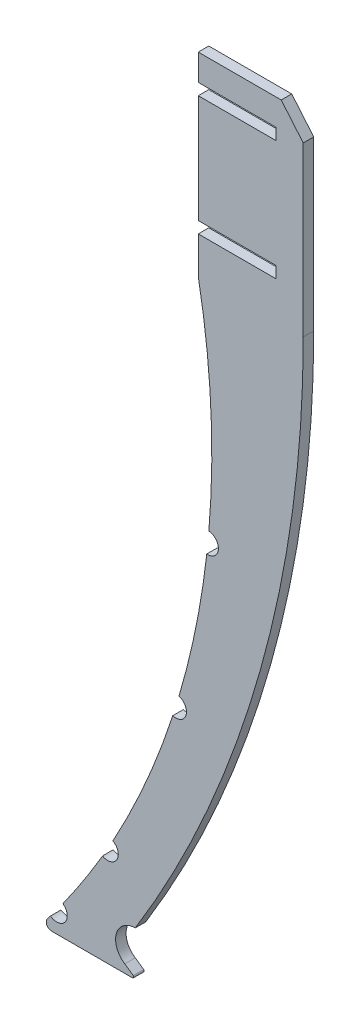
ISO-10303-21;
HEADER;
FILE_DESCRIPTION(('STEP AP214'),'2;1');
FILE_NAME('part.step','',(''),(''),'','','');
FILE_SCHEMA(('AUTOMOTIVE_DESIGN { 1 0 10303 214 1 1 1 1 }'));
ENDSEC;
DATA;
#1=APPLICATION_CONTEXT('core data for automotive mechanical design processes');
#2=APPLICATION_PROTOCOL_DEFINITION('international standard','automotive_design',2000,#1);
#3=PRODUCT_CONTEXT('',#1,'mechanical');
#4=PRODUCT('Part','Part','',(#3));
#5=PRODUCT_RELATED_PRODUCT_CATEGORY('part','',(#4));
#6=PRODUCT_DEFINITION_FORMATION('','',#4);
#7=PRODUCT_DEFINITION_CONTEXT('part definition',#1,'design');
#8=PRODUCT_DEFINITION('design','',#6,#7);
#9=PRODUCT_DEFINITION_SHAPE('','',#8);
#10=(LENGTH_UNIT() NAMED_UNIT(*) SI_UNIT(.MILLI.,.METRE.));
#11=(NAMED_UNIT(*) PLANE_ANGLE_UNIT() SI_UNIT($,.RADIAN.));
#12=(NAMED_UNIT(*) SI_UNIT($,.STERADIAN.) SOLID_ANGLE_UNIT());
#13=UNCERTAINTY_MEASURE_WITH_UNIT(LENGTH_MEASURE(1.E-05),#10,'distance_accuracy_value','');
#14=(GEOMETRIC_REPRESENTATION_CONTEXT(3) GLOBAL_UNCERTAINTY_ASSIGNED_CONTEXT((#13)) GLOBAL_UNIT_ASSIGNED_CONTEXT((#10,
#11,#12)) REPRESENTATION_CONTEXT('',''));
#15=CARTESIAN_POINT('',(0.,0.,0.));
#16=DIRECTION('',(0.,0.,1.));
#17=DIRECTION('',(1.,0.,0.));
#18=AXIS2_PLACEMENT_3D('',#15,#16,#17);
#19=CARTESIAN_POINT('',(-13.9999999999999,-155.222144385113,1.5));
#20=DIRECTION('',(-0.574159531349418,-0.81874344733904,0.));
#21=DIRECTION('',(-0.81874344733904,0.574159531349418,0.));
#22=AXIS2_PLACEMENT_3D('',#19,#20,#21);
#23=PLANE('',#22);
#24=DIRECTION('',(0.,0.,1.));
#25=VECTOR('',#24,1.);
#26=CARTESIAN_POINT('',(-12.3983756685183,-156.345314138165,1.5));
#27=LINE('',#26,#25);
#28=CARTESIAN_POINT('',(-12.3983756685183,-156.345314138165,-0.5));
#29=VERTEX_POINT('',#28);
#30=CARTESIAN_POINT('',(-12.3983756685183,-156.345314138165,1.5));
#31=VERTEX_POINT('',#30);
#32=EDGE_CURVE('E11',#29,#31,#27,.T.);
#33=ORIENTED_EDGE('',*,*,#32,.F.);
#34=DIRECTION('',(-0.81874344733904,0.574159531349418,0.));
#35=VECTOR('',#34,1.);
#36=CARTESIAN_POINT('',(-13.9999999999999,-155.222144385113,-0.5));
#37=LINE('',#36,#35);
#38=CARTESIAN_POINT('',(-14.,-155.222144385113,-0.5));
#39=VERTEX_POINT('',#38);
#40=EDGE_CURVE('E158',#29,#39,#37,.T.);
#41=ORIENTED_EDGE('',*,*,#40,.T.);
#42=DIRECTION('',(0.,0.,1.));
#43=VECTOR('',#42,1.);
#44=CARTESIAN_POINT('',(-13.9999999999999,-155.222144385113,1.5));
#45=LINE('',#44,#43);
#46=CARTESIAN_POINT('',(-13.9999999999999,-155.222144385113,1.5));
#47=VERTEX_POINT('',#46);
#48=EDGE_CURVE('E44',#39,#47,#45,.T.);
#49=ORIENTED_EDGE('',*,*,#48,.T.);
#50=DIRECTION('',(-0.81874344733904,0.574159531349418,0.));
#51=VECTOR('',#50,1.);
#52=CARTESIAN_POINT('',(-13.9999999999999,-155.222144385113,1.5));
#53=LINE('',#52,#51);
#54=EDGE_CURVE('E311',#31,#47,#53,.T.);
#55=ORIENTED_EDGE('',*,*,#54,.F.);
#56=EDGE_LOOP('',(#33,#41,#49,#55));
#57=FACE_BOUND('',#56,.T.);
#58=ADVANCED_FACE('F34',(#57),#23,.F.);
#59=CARTESIAN_POINT('',(-11.9999999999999,-152.05,1.5));
#60=DIRECTION('',(0.,0.,-1.));
#61=DIRECTION('',(-1.,0.,0.));
#62=AXIS2_PLACEMENT_3D('',#59,#60,#61);
#63=CYLINDRICAL_SURFACE('',#62,3.75000000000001);
#64=ORIENTED_EDGE('',*,*,#48,.F.);
#65=CARTESIAN_POINT('',(-11.9999999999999,-152.05,-0.5));
#66=DIRECTION('',(0.,0.,-1.));
#67=DIRECTION('',(-1.,0.,0.));
#68=AXIS2_PLACEMENT_3D('',#65,#66,#67);
#69=CIRCLE('',#68,3.75000000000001);
#70=CARTESIAN_POINT('',(-12.,-148.3,-0.5));
#71=VERTEX_POINT('',#70);
#72=EDGE_CURVE('E234',#39,#71,#69,.T.);
#73=ORIENTED_EDGE('',*,*,#72,.T.);
#74=DIRECTION('',(0.,0.,1.));
#75=VECTOR('',#74,1.);
#76=CARTESIAN_POINT('',(-12.,-148.3,1.5));
#77=LINE('',#76,#75);
#78=CARTESIAN_POINT('',(-12.,-148.3,1.5));
#79=VERTEX_POINT('',#78);
#80=EDGE_CURVE('E304',#71,#79,#77,.T.);
#81=ORIENTED_EDGE('',*,*,#80,.T.);
#82=CARTESIAN_POINT('',(-11.9999999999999,-152.05,1.5));
#83=DIRECTION('',(0.,0.,-1.));
#84=DIRECTION('',(1.,0.,0.));
#85=AXIS2_PLACEMENT_3D('',#82,#83,#84);
#86=CIRCLE('',#85,3.75000000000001);
#87=EDGE_CURVE('E320',#47,#79,#86,.T.);
#88=ORIENTED_EDGE('',*,*,#87,.F.);
#89=EDGE_LOOP('',(#64,#73,#81,#88));
#90=FACE_BOUND('',#89,.T.);
#91=ADVANCED_FACE('F323',(#90),#63,.F.);
#92=CARTESIAN_POINT('',(-197.285156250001,-34.8,1.5));
#93=DIRECTION('',(0.,0.,1.));
#94=DIRECTION('',(1.,0.,0.));
#95=AXIS2_PLACEMENT_3D('',#92,#93,#94);
#96=CYLINDRICAL_SURFACE('',#95,217.285156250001);
#97=ORIENTED_EDGE('',*,*,#80,.F.);
#98=CARTESIAN_POINT('',(-197.285156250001,-34.8,-0.5));
#99=DIRECTION('',(0.,0.,1.));
#100=DIRECTION('',(1.,0.,0.));
#101=AXIS2_PLACEMENT_3D('',#98,#99,#100);
#102=CIRCLE('',#101,217.285156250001);
#103=CARTESIAN_POINT('',(20.,-34.8,-0.5));
#104=VERTEX_POINT('',#103);
#105=EDGE_CURVE('E231',#71,#104,#102,.T.);
#106=ORIENTED_EDGE('',*,*,#105,.T.);
#107=DIRECTION('',(0.,0.,1.));
#108=VECTOR('',#107,1.);
#109=CARTESIAN_POINT('',(20.,-34.8,1.5));
#110=LINE('',#109,#108);
#111=CARTESIAN_POINT('',(20.,-34.8,1.5));
#112=VERTEX_POINT('',#111);
#113=EDGE_CURVE('E301',#104,#112,#110,.T.);
#114=ORIENTED_EDGE('',*,*,#113,.T.);
#115=CARTESIAN_POINT('',(-197.285156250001,-34.8,1.5));
#116=DIRECTION('',(0.,0.,1.));
#117=DIRECTION('',(-1.,0.,0.));
#118=AXIS2_PLACEMENT_3D('',#115,#116,#117);
#119=CIRCLE('',#118,217.285156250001);
#120=EDGE_CURVE('E324',#79,#112,#119,.T.);
#121=ORIENTED_EDGE('',*,*,#120,.F.);
#122=EDGE_LOOP('',(#97,#106,#114,#121));
#123=FACE_BOUND('',#122,.T.);
#124=ADVANCED_FACE('F516',(#123),#96,.T.);
#125=CARTESIAN_POINT('',(20.,2.2,1.5));
#126=DIRECTION('',(-1.,0.,0.));
#127=DIRECTION('',(0.,1.,0.));
#128=AXIS2_PLACEMENT_3D('',#125,#126,#127);
#129=PLANE('',#128);
#130=ORIENTED_EDGE('',*,*,#113,.F.);
#131=DIRECTION('',(0.,1.,0.));
#132=VECTOR('',#131,1.);
#133=CARTESIAN_POINT('',(20.,-34.8,-0.5));
#134=LINE('',#133,#132);
#135=CARTESIAN_POINT('',(20.,-2.80000000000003,-0.5));
#136=VERTEX_POINT('',#135);
#137=EDGE_CURVE('E228',#104,#136,#134,.T.);
#138=ORIENTED_EDGE('',*,*,#137,.T.);
#139=DIRECTION('',(0.,0.,1.));
#140=VECTOR('',#139,1.);
#141=CARTESIAN_POINT('',(20.,-2.80000000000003,1.5));
#142=LINE('',#141,#140);
#143=CARTESIAN_POINT('',(20.,-2.80000000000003,1.5));
#144=VERTEX_POINT('',#143);
#145=EDGE_CURVE('E298',#136,#144,#142,.T.);
#146=ORIENTED_EDGE('',*,*,#145,.T.);
#147=DIRECTION('',(0.,1.,0.));
#148=VECTOR('',#147,1.);
#149=CARTESIAN_POINT('',(20.,2.2,1.5));
#150=LINE('',#149,#148);
#151=EDGE_CURVE('E326',#112,#144,#150,.T.);
#152=ORIENTED_EDGE('',*,*,#151,.F.);
#153=EDGE_LOOP('',(#130,#138,#146,#152));
#154=FACE_BOUND('',#153,.T.);
#155=ADVANCED_FACE('F514',(#154),#129,.F.);
#156=CARTESIAN_POINT('',(15.8045018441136,2.2,1.5));
#157=DIRECTION('',(0.76604444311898,0.642787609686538,0.));
#158=DIRECTION('',(0.642787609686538,-0.76604444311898,0.));
#159=AXIS2_PLACEMENT_3D('',#156,#157,#158);
#160=PLANE('',#159);
#161=ORIENTED_EDGE('',*,*,#145,.F.);
#162=DIRECTION('',(0.642787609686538,-0.76604444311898,0.));
#163=VECTOR('',#162,1.);
#164=CARTESIAN_POINT('',(15.8045018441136,2.2,-0.5));
#165=LINE('',#164,#163);
#166=CARTESIAN_POINT('',(15.8045018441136,2.2,-0.5));
#167=VERTEX_POINT('',#166);
#168=EDGE_CURVE('E225',#136,#167,#165,.F.);
#169=ORIENTED_EDGE('',*,*,#168,.T.);
#170=DIRECTION('',(0.,0.,1.));
#171=VECTOR('',#170,1.);
#172=CARTESIAN_POINT('',(15.8045018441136,2.2,1.5));
#173=LINE('',#172,#171);
#174=CARTESIAN_POINT('',(15.8045018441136,2.2,1.5));
#175=VERTEX_POINT('',#174);
#176=EDGE_CURVE('E295',#167,#175,#173,.T.);
#177=ORIENTED_EDGE('',*,*,#176,.T.);
#178=DIRECTION('',(0.642787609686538,-0.76604444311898,0.));
#179=VECTOR('',#178,1.);
#180=CARTESIAN_POINT('',(15.8045018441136,2.2,1.5));
#181=LINE('',#180,#179);
#182=EDGE_CURVE('E332',#144,#175,#181,.F.);
#183=ORIENTED_EDGE('',*,*,#182,.F.);
#184=EDGE_LOOP('',(#161,#169,#177,#183));
#185=FACE_BOUND('',#184,.T.);
#186=ADVANCED_FACE('F509',(#185),#160,.T.);
#187=CARTESIAN_POINT('',(0.,2.2,1.5));
#188=DIRECTION('',(0.,-1.,0.));
#189=DIRECTION('',(-1.,0.,0.));
#190=AXIS2_PLACEMENT_3D('',#187,#188,#189);
#191=PLANE('',#190);
#192=ORIENTED_EDGE('',*,*,#176,.F.);
#193=DIRECTION('',(-1.,0.,0.));
#194=VECTOR('',#193,1.);
#195=CARTESIAN_POINT('',(-197.285156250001,2.2,-0.5));
#196=LINE('',#195,#194);
#197=CARTESIAN_POINT('',(0.,2.2,-0.5));
#198=VERTEX_POINT('',#197);
#199=EDGE_CURVE('E222',#167,#198,#196,.T.);
#200=ORIENTED_EDGE('',*,*,#199,.T.);
#201=DIRECTION('',(0.,0.,1.));
#202=VECTOR('',#201,1.);
#203=CARTESIAN_POINT('',(0.,2.2,1.5));
#204=LINE('',#203,#202);
#205=CARTESIAN_POINT('',(0.,2.2,1.5));
#206=VERTEX_POINT('',#205);
#207=EDGE_CURVE('E292',#198,#206,#204,.T.);
#208=ORIENTED_EDGE('',*,*,#207,.T.);
#209=DIRECTION('',(-1.,0.,0.));
#210=VECTOR('',#209,1.);
#211=CARTESIAN_POINT('',(0.,2.2,1.5));
#212=LINE('',#211,#210);
#213=EDGE_CURVE('E335',#175,#206,#212,.T.);
#214=ORIENTED_EDGE('',*,*,#213,.F.);
#215=EDGE_LOOP('',(#192,#200,#208,#214));
#216=FACE_BOUND('',#215,.T.);
#217=ADVANCED_FACE('F505',(#216),#191,.F.);
#218=CARTESIAN_POINT('',(0.,-2.8,1.5));
#219=DIRECTION('',(1.,0.,0.));
#220=DIRECTION('',(0.,-1.,0.));
#221=AXIS2_PLACEMENT_3D('',#218,#219,#220);
#222=PLANE('',#221);
#223=ORIENTED_EDGE('',*,*,#207,.F.);
#224=DIRECTION('',(0.,1.,0.));
#225=VECTOR('',#224,1.);
#226=CARTESIAN_POINT('',(0.,-34.8,-0.5));
#227=LINE('',#226,#225);
#228=CARTESIAN_POINT('',(0.,-2.8,-0.5));
#229=VERTEX_POINT('',#228);
#230=EDGE_CURVE('E219',#198,#229,#227,.F.);
#231=ORIENTED_EDGE('',*,*,#230,.T.);
#232=DIRECTION('',(0.,0.,1.));
#233=VECTOR('',#232,1.);
#234=CARTESIAN_POINT('',(0.,-2.8,1.5));
#235=LINE('',#234,#233);
#236=CARTESIAN_POINT('',(0.,-2.8,1.5));
#237=VERTEX_POINT('',#236);
#238=EDGE_CURVE('E289',#229,#237,#235,.T.);
#239=ORIENTED_EDGE('',*,*,#238,.T.);
#240=DIRECTION('',(0.,-1.,0.));
#241=VECTOR('',#240,1.);
#242=CARTESIAN_POINT('',(0.,-2.8,1.5));
#243=LINE('',#242,#241);
#244=EDGE_CURVE('E338',#206,#237,#243,.T.);
#245=ORIENTED_EDGE('',*,*,#244,.F.);
#246=EDGE_LOOP('',(#223,#231,#239,#245));
#247=FACE_BOUND('',#246,.T.);
#248=ADVANCED_FACE('F502',(#247),#222,.F.);
#249=CARTESIAN_POINT('',(0.,-2.8,1.5));
#250=DIRECTION('',(0.,1.,0.));
#251=DIRECTION('',(1.,0.,0.));
#252=AXIS2_PLACEMENT_3D('',#249,#250,#251);
#253=PLANE('',#252);
#254=ORIENTED_EDGE('',*,*,#238,.F.);
#255=DIRECTION('',(-1.,0.,0.));
#256=VECTOR('',#255,1.);
#257=CARTESIAN_POINT('',(-197.285156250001,-2.8,-0.5));
#258=LINE('',#257,#256);
#259=CARTESIAN_POINT('',(14.77,-2.8,-0.5));
#260=VERTEX_POINT('',#259);
#261=EDGE_CURVE('E216',#229,#260,#258,.F.);
#262=ORIENTED_EDGE('',*,*,#261,.T.);
#263=DIRECTION('',(0.,0.,1.));
#264=VECTOR('',#263,1.);
#265=CARTESIAN_POINT('',(14.77,-2.8,1.5));
#266=LINE('',#265,#264);
#267=CARTESIAN_POINT('',(14.77,-2.8,1.5));
#268=VERTEX_POINT('',#267);
#269=EDGE_CURVE('E286',#260,#268,#266,.T.);
#270=ORIENTED_EDGE('',*,*,#269,.T.);
#271=DIRECTION('',(1.,0.,0.));
#272=VECTOR('',#271,1.);
#273=CARTESIAN_POINT('',(0.,-2.8,1.5));
#274=LINE('',#273,#272);
#275=EDGE_CURVE('E341',#237,#268,#274,.T.);
#276=ORIENTED_EDGE('',*,*,#275,.F.);
#277=EDGE_LOOP('',(#254,#262,#270,#276));
#278=FACE_BOUND('',#277,.T.);
#279=ADVANCED_FACE('F497',(#278),#253,.F.);
#280=CARTESIAN_POINT('',(14.77,-2.8,1.5));
#281=DIRECTION('',(1.,0.,0.));
#282=DIRECTION('',(0.,-1.,0.));
#283=AXIS2_PLACEMENT_3D('',#280,#281,#282);
#284=PLANE('',#283);
#285=ORIENTED_EDGE('',*,*,#269,.F.);
#286=DIRECTION('',(0.,1.,0.));
#287=VECTOR('',#286,1.);
#288=CARTESIAN_POINT('',(14.77,-34.8,-0.5));
#289=LINE('',#288,#287);
#290=CARTESIAN_POINT('',(14.77,-5.,-0.5));
#291=VERTEX_POINT('',#290);
#292=EDGE_CURVE('E213',#260,#291,#289,.F.);
#293=ORIENTED_EDGE('',*,*,#292,.T.);
#294=DIRECTION('',(0.,0.,1.));
#295=VECTOR('',#294,1.);
#296=CARTESIAN_POINT('',(14.77,-5.,1.5));
#297=LINE('',#296,#295);
#298=CARTESIAN_POINT('',(14.77,-5.,1.5));
#299=VERTEX_POINT('',#298);
#300=EDGE_CURVE('E283',#291,#299,#297,.T.);
#301=ORIENTED_EDGE('',*,*,#300,.T.);
#302=DIRECTION('',(0.,-1.,0.));
#303=VECTOR('',#302,1.);
#304=CARTESIAN_POINT('',(14.77,-2.8,1.5));
#305=LINE('',#304,#303);
#306=EDGE_CURVE('E344',#268,#299,#305,.T.);
#307=ORIENTED_EDGE('',*,*,#306,.F.);
#308=EDGE_LOOP('',(#285,#293,#301,#307));
#309=FACE_BOUND('',#308,.T.);
#310=ADVANCED_FACE('F493',(#309),#284,.F.);
#311=CARTESIAN_POINT('',(0.,-5.,1.5));
#312=DIRECTION('',(0.,-1.,0.));
#313=DIRECTION('',(-1.,0.,0.));
#314=AXIS2_PLACEMENT_3D('',#311,#312,#313);
#315=PLANE('',#314);
#316=ORIENTED_EDGE('',*,*,#300,.F.);
#317=DIRECTION('',(-1.,0.,0.));
#318=VECTOR('',#317,1.);
#319=CARTESIAN_POINT('',(-197.285156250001,-5.,-0.5));
#320=LINE('',#319,#318);
#321=CARTESIAN_POINT('',(0.,-5.,-0.5));
#322=VERTEX_POINT('',#321);
#323=EDGE_CURVE('E210',#291,#322,#320,.T.);
#324=ORIENTED_EDGE('',*,*,#323,.T.);
#325=DIRECTION('',(0.,0.,1.));
#326=VECTOR('',#325,1.);
#327=CARTESIAN_POINT('',(0.,-5.,1.5));
#328=LINE('',#327,#326);
#329=CARTESIAN_POINT('',(0.,-5.,1.5));
#330=VERTEX_POINT('',#329);
#331=EDGE_CURVE('E280',#322,#330,#328,.T.);
#332=ORIENTED_EDGE('',*,*,#331,.T.);
#333=DIRECTION('',(-1.,0.,0.));
#334=VECTOR('',#333,1.);
#335=CARTESIAN_POINT('',(0.,-5.,1.5));
#336=LINE('',#335,#334);
#337=EDGE_CURVE('E347',#299,#330,#336,.T.);
#338=ORIENTED_EDGE('',*,*,#337,.F.);
#339=EDGE_LOOP('',(#316,#324,#332,#338));
#340=FACE_BOUND('',#339,.T.);
#341=ADVANCED_FACE('F490',(#340),#315,.F.);
#342=CARTESIAN_POINT('',(0.,-5.,1.5));
#343=DIRECTION('',(1.,0.,0.));
#344=DIRECTION('',(0.,-1.,0.));
#345=AXIS2_PLACEMENT_3D('',#342,#343,#344);
#346=PLANE('',#345);
#347=ORIENTED_EDGE('',*,*,#331,.F.);
#348=DIRECTION('',(0.,1.,0.));
#349=VECTOR('',#348,1.);
#350=CARTESIAN_POINT('',(0.,-34.8,-0.5));
#351=LINE('',#350,#349);
#352=CARTESIAN_POINT('',(0.,-25.6,-0.5));
#353=VERTEX_POINT('',#352);
#354=EDGE_CURVE('E207',#322,#353,#351,.F.);
#355=ORIENTED_EDGE('',*,*,#354,.T.);
#356=DIRECTION('',(0.,0.,1.));
#357=VECTOR('',#356,1.);
#358=CARTESIAN_POINT('',(0.,-25.6,1.5));
#359=LINE('',#358,#357);
#360=CARTESIAN_POINT('',(0.,-25.6,1.5));
#361=VERTEX_POINT('',#360);
#362=EDGE_CURVE('E277',#353,#361,#359,.T.);
#363=ORIENTED_EDGE('',*,*,#362,.T.);
#364=DIRECTION('',(0.,-1.,0.));
#365=VECTOR('',#364,1.);
#366=CARTESIAN_POINT('',(0.,-5.,1.5));
#367=LINE('',#366,#365);
#368=EDGE_CURVE('E350',#330,#361,#367,.T.);
#369=ORIENTED_EDGE('',*,*,#368,.F.);
#370=EDGE_LOOP('',(#347,#355,#363,#369));
#371=FACE_BOUND('',#370,.T.);
#372=ADVANCED_FACE('F485',(#371),#346,.F.);
#373=CARTESIAN_POINT('',(0.,-25.6,1.5));
#374=DIRECTION('',(0.,1.,0.));
#375=DIRECTION('',(1.,0.,0.));
#376=AXIS2_PLACEMENT_3D('',#373,#374,#375);
#377=PLANE('',#376);
#378=ORIENTED_EDGE('',*,*,#362,.F.);
#379=DIRECTION('',(-1.,0.,0.));
#380=VECTOR('',#379,1.);
#381=CARTESIAN_POINT('',(-197.285156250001,-25.6,-0.5));
#382=LINE('',#381,#380);
#383=CARTESIAN_POINT('',(14.77,-25.6,-0.5));
#384=VERTEX_POINT('',#383);
#385=EDGE_CURVE('E204',#353,#384,#382,.F.);
#386=ORIENTED_EDGE('',*,*,#385,.T.);
#387=DIRECTION('',(0.,0.,1.));
#388=VECTOR('',#387,1.);
#389=CARTESIAN_POINT('',(14.77,-25.6,1.5));
#390=LINE('',#389,#388);
#391=CARTESIAN_POINT('',(14.77,-25.6,1.5));
#392=VERTEX_POINT('',#391);
#393=EDGE_CURVE('E274',#384,#392,#390,.T.);
#394=ORIENTED_EDGE('',*,*,#393,.T.);
#395=DIRECTION('',(1.,0.,0.));
#396=VECTOR('',#395,1.);
#397=CARTESIAN_POINT('',(0.,-25.6,1.5));
#398=LINE('',#397,#396);
#399=EDGE_CURVE('E353',#361,#392,#398,.T.);
#400=ORIENTED_EDGE('',*,*,#399,.F.);
#401=EDGE_LOOP('',(#378,#386,#394,#400));
#402=FACE_BOUND('',#401,.T.);
#403=ADVANCED_FACE('F481',(#402),#377,.F.);
#404=CARTESIAN_POINT('',(14.77,-25.6,1.5));
#405=DIRECTION('',(1.,0.,0.));
#406=DIRECTION('',(0.,-1.,0.));
#407=AXIS2_PLACEMENT_3D('',#404,#405,#406);
#408=PLANE('',#407);
#409=ORIENTED_EDGE('',*,*,#393,.F.);
#410=DIRECTION('',(0.,1.,0.));
#411=VECTOR('',#410,1.);
#412=CARTESIAN_POINT('',(14.77,-34.8,-0.5));
#413=LINE('',#412,#411);
#414=CARTESIAN_POINT('',(14.77,-27.8,-0.5));
#415=VERTEX_POINT('',#414);
#416=EDGE_CURVE('E201',#384,#415,#413,.F.);
#417=ORIENTED_EDGE('',*,*,#416,.T.);
#418=DIRECTION('',(0.,0.,1.));
#419=VECTOR('',#418,1.);
#420=CARTESIAN_POINT('',(14.77,-27.8,1.5));
#421=LINE('',#420,#419);
#422=CARTESIAN_POINT('',(14.77,-27.8,1.5));
#423=VERTEX_POINT('',#422);
#424=EDGE_CURVE('E271',#415,#423,#421,.T.);
#425=ORIENTED_EDGE('',*,*,#424,.T.);
#426=DIRECTION('',(0.,-1.,0.));
#427=VECTOR('',#426,1.);
#428=CARTESIAN_POINT('',(14.77,-25.6,1.5));
#429=LINE('',#428,#427);
#430=EDGE_CURVE('E356',#392,#423,#429,.T.);
#431=ORIENTED_EDGE('',*,*,#430,.F.);
#432=EDGE_LOOP('',(#409,#417,#425,#431));
#433=FACE_BOUND('',#432,.T.);
#434=ADVANCED_FACE('F478',(#433),#408,.F.);
#435=CARTESIAN_POINT('',(0.,-27.8,1.5));
#436=DIRECTION('',(0.,-1.,0.));
#437=DIRECTION('',(-1.,0.,0.));
#438=AXIS2_PLACEMENT_3D('',#435,#436,#437);
#439=PLANE('',#438);
#440=ORIENTED_EDGE('',*,*,#424,.F.);
#441=DIRECTION('',(-1.,0.,0.));
#442=VECTOR('',#441,1.);
#443=CARTESIAN_POINT('',(-197.285156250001,-27.8,-0.5));
#444=LINE('',#443,#442);
#445=CARTESIAN_POINT('',(0.,-27.8,-0.5));
#446=VERTEX_POINT('',#445);
#447=EDGE_CURVE('E198',#415,#446,#444,.T.);
#448=ORIENTED_EDGE('',*,*,#447,.T.);
#449=DIRECTION('',(0.,0.,1.));
#450=VECTOR('',#449,1.);
#451=CARTESIAN_POINT('',(0.,-27.8,1.5));
#452=LINE('',#451,#450);
#453=CARTESIAN_POINT('',(0.,-27.8,1.5));
#454=VERTEX_POINT('',#453);
#455=EDGE_CURVE('E268',#446,#454,#452,.T.);
#456=ORIENTED_EDGE('',*,*,#455,.T.);
#457=DIRECTION('',(-1.,0.,0.));
#458=VECTOR('',#457,1.);
#459=CARTESIAN_POINT('',(0.,-27.8,1.5));
#460=LINE('',#459,#458);
#461=EDGE_CURVE('E359',#423,#454,#460,.T.);
#462=ORIENTED_EDGE('',*,*,#461,.F.);
#463=EDGE_LOOP('',(#440,#448,#456,#462));
#464=FACE_BOUND('',#463,.T.);
#465=ADVANCED_FACE('F473',(#464),#439,.F.);
#466=CARTESIAN_POINT('',(0.,-27.8,1.5));
#467=DIRECTION('',(1.,0.,0.));
#468=DIRECTION('',(0.,-1.,0.));
#469=AXIS2_PLACEMENT_3D('',#466,#467,#468);
#470=PLANE('',#469);
#471=ORIENTED_EDGE('',*,*,#455,.F.);
#472=DIRECTION('',(0.,1.,0.));
#473=VECTOR('',#472,1.);
#474=CARTESIAN_POINT('',(0.,-34.8,-0.5));
#475=LINE('',#474,#473);
#476=CARTESIAN_POINT('',(0.,-34.8,-0.5));
#477=VERTEX_POINT('',#476);
#478=EDGE_CURVE('E195',#446,#477,#475,.F.);
#479=ORIENTED_EDGE('',*,*,#478,.T.);
#480=DIRECTION('',(0.,0.,1.));
#481=VECTOR('',#480,1.);
#482=CARTESIAN_POINT('',(0.,-34.8,1.5));
#483=LINE('',#482,#481);
#484=CARTESIAN_POINT('',(0.,-34.8,1.5));
#485=VERTEX_POINT('',#484);
#486=EDGE_CURVE('E265',#477,#485,#483,.T.);
#487=ORIENTED_EDGE('',*,*,#486,.T.);
#488=DIRECTION('',(0.,-1.,0.));
#489=VECTOR('',#488,1.);
#490=CARTESIAN_POINT('',(0.,-27.8,1.5));
#491=LINE('',#490,#489);
#492=EDGE_CURVE('E362',#454,#485,#491,.T.);
#493=ORIENTED_EDGE('',*,*,#492,.F.);
#494=EDGE_LOOP('',(#471,#479,#487,#493));
#495=FACE_BOUND('',#494,.T.);
#496=ADVANCED_FACE('F469',(#495),#470,.F.);
#497=CARTESIAN_POINT('',(-149.53282032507,-62.7181589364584,1.5));
#498=DIRECTION('',(0.,0.,-1.));
#499=DIRECTION('',(-1.,0.,0.));
#500=AXIS2_PLACEMENT_3D('',#497,#498,#499);
#501=CYLINDRICAL_SURFACE('',#500,152.11669189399);
#502=ORIENTED_EDGE('',*,*,#486,.F.);
#503=CARTESIAN_POINT('',(-149.53282032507,-62.7181589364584,-0.5));
#504=DIRECTION('',(0.,0.,-1.));
#505=DIRECTION('',(-1.,0.,0.));
#506=AXIS2_PLACEMENT_3D('',#503,#504,#505);
#507=CIRCLE('',#506,152.11669189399);
#508=CARTESIAN_POINT('',(2.01957480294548,-75.8085937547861,-0.5));
#509=VERTEX_POINT('',#508);
#510=EDGE_CURVE('E192',#477,#509,#507,.T.);
#511=ORIENTED_EDGE('',*,*,#510,.T.);
#512=DIRECTION('',(0.,0.,1.));
#513=VECTOR('',#512,1.);
#514=CARTESIAN_POINT('',(2.01957480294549,-75.8085937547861,1.5));
#515=LINE('',#514,#513);
#516=CARTESIAN_POINT('',(2.01957480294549,-75.8085937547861,1.5));
#517=VERTEX_POINT('',#516);
#518=EDGE_CURVE('E262',#509,#517,#515,.T.);
#519=ORIENTED_EDGE('',*,*,#518,.T.);
#520=CARTESIAN_POINT('',(-149.53282032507,-62.7181589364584,1.5));
#521=DIRECTION('',(0.,0.,-1.));
#522=DIRECTION('',(-1.,0.,0.));
#523=AXIS2_PLACEMENT_3D('',#520,#521,#522);
#524=CIRCLE('',#523,152.11669189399);
#525=EDGE_CURVE('E365',#485,#517,#524,.T.);
#526=ORIENTED_EDGE('',*,*,#525,.F.);
#527=EDGE_LOOP('',(#502,#511,#519,#526));
#528=FACE_BOUND('',#527,.T.);
#529=ADVANCED_FACE('F465',(#528),#501,.F.);
#530=CARTESIAN_POINT('',(1.83436906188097,-77.8,1.5));
#531=DIRECTION('',(0.,0.,1.));
#532=DIRECTION('',(1.,0.,0.));
#533=AXIS2_PLACEMENT_3D('',#530,#531,#532);
#534=CYLINDRICAL_SURFACE('',#533,2.);
#535=ORIENTED_EDGE('',*,*,#518,.F.);
#536=CARTESIAN_POINT('',(1.83436906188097,-77.8,-0.5));
#537=DIRECTION('',(0.,0.,1.));
#538=DIRECTION('',(1.,0.,0.));
#539=AXIS2_PLACEMENT_3D('',#536,#537,#538);
#540=CIRCLE('',#539,2.);
#541=CARTESIAN_POINT('',(1.62299728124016,-79.7887991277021,-0.5));
#542=VERTEX_POINT('',#541);
#543=EDGE_CURVE('E189',#542,#509,#540,.T.);
#544=ORIENTED_EDGE('',*,*,#543,.F.);
#545=DIRECTION('',(0.,0.,1.));
#546=VECTOR('',#545,1.);
#547=CARTESIAN_POINT('',(1.62299728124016,-79.7887991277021,1.5));
#548=LINE('',#547,#546);
#549=CARTESIAN_POINT('',(1.62299728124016,-79.7887991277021,1.5));
#550=VERTEX_POINT('',#549);
#551=EDGE_CURVE('E259',#542,#550,#548,.T.);
#552=ORIENTED_EDGE('',*,*,#551,.T.);
#553=CARTESIAN_POINT('',(1.83436906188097,-77.8,1.5));
#554=DIRECTION('',(0.,0.,1.));
#555=DIRECTION('',(1.,0.,0.));
#556=AXIS2_PLACEMENT_3D('',#553,#554,#555);
#557=CIRCLE('',#556,2.);
#558=EDGE_CURVE('E368',#550,#517,#557,.T.);
#559=ORIENTED_EDGE('',*,*,#558,.T.);
#560=EDGE_LOOP('',(#535,#544,#552,#559));
#561=FACE_BOUND('',#560,.T.);
#562=ADVANCED_FACE('F460',(#561),#534,.F.);
#563=ORIENTED_EDGE('',*,*,#551,.F.);
#564=CARTESIAN_POINT('',(-149.53282032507,-62.7181589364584,-0.5));
#565=DIRECTION('',(0.,0.,-1.));
#566=DIRECTION('',(-1.,0.,0.));
#567=AXIS2_PLACEMENT_3D('',#564,#565,#566);
#568=CIRCLE('',#567,152.11669189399);
#569=CARTESIAN_POINT('',(-3.66978203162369,-105.885994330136,-0.5));
#570=VERTEX_POINT('',#569);
#571=EDGE_CURVE('E186',#542,#570,#568,.T.);
#572=ORIENTED_EDGE('',*,*,#571,.T.);
#573=DIRECTION('',(0.,0.,1.));
#574=VECTOR('',#573,1.);
#575=CARTESIAN_POINT('',(-3.66978203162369,-105.885994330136,1.5));
#576=LINE('',#575,#574);
#577=CARTESIAN_POINT('',(-3.66978203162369,-105.885994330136,1.5));
#578=VERTEX_POINT('',#577);
#579=EDGE_CURVE('E256',#570,#578,#576,.T.);
#580=ORIENTED_EDGE('',*,*,#579,.T.);
#581=EDGE_CURVE('E370',#550,#578,#524,.T.);
#582=ORIENTED_EDGE('',*,*,#581,.F.);
#583=EDGE_LOOP('',(#563,#572,#580,#582));
#584=FACE_BOUND('',#583,.T.);
#585=ADVANCED_FACE('F461',(#584),#501,.F.);
#586=CARTESIAN_POINT('',(-4.24993916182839,-107.8,1.5));
#587=DIRECTION('',(0.,0.,1.));
#588=DIRECTION('',(1.,0.,0.));
#589=AXIS2_PLACEMENT_3D('',#586,#587,#588);
#590=CYLINDRICAL_SURFACE('',#589,2.);
#591=ORIENTED_EDGE('',*,*,#579,.F.);
#592=CARTESIAN_POINT('',(-4.24993916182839,-107.8,-0.5));
#593=DIRECTION('',(0.,0.,1.));
#594=DIRECTION('',(1.,0.,0.));
#595=AXIS2_PLACEMENT_3D('',#592,#593,#594);
#596=CIRCLE('',#595,2.);
#597=CARTESIAN_POINT('',(-4.85521056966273,-109.706212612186,-0.5));
#598=VERTEX_POINT('',#597);
#599=EDGE_CURVE('E183',#598,#570,#596,.T.);
#600=ORIENTED_EDGE('',*,*,#599,.F.);
#601=DIRECTION('',(0.,0.,1.));
#602=VECTOR('',#601,1.);
#603=CARTESIAN_POINT('',(-4.85521056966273,-109.706212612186,1.5));
#604=LINE('',#603,#602);
#605=CARTESIAN_POINT('',(-4.85521056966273,-109.706212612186,1.5));
#606=VERTEX_POINT('',#605);
#607=EDGE_CURVE('E253',#598,#606,#604,.T.);
#608=ORIENTED_EDGE('',*,*,#607,.T.);
#609=CARTESIAN_POINT('',(-4.24993916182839,-107.8,1.5));
#610=DIRECTION('',(0.,0.,1.));
#611=DIRECTION('',(1.,0.,0.));
#612=AXIS2_PLACEMENT_3D('',#609,#610,#611);
#613=CIRCLE('',#612,2.);
#614=EDGE_CURVE('E373',#606,#578,#613,.T.);
#615=ORIENTED_EDGE('',*,*,#614,.T.);
#616=EDGE_LOOP('',(#591,#600,#608,#615));
#617=FACE_BOUND('',#616,.T.);
#618=ADVANCED_FACE('F402',(#617),#590,.F.);
#619=ORIENTED_EDGE('',*,*,#607,.F.);
#620=CARTESIAN_POINT('',(-149.53282032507,-62.7181589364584,-0.5));
#621=DIRECTION('',(0.,0.,-1.));
#622=DIRECTION('',(-1.,0.,0.));
#623=AXIS2_PLACEMENT_3D('',#620,#621,#622);
#624=CIRCLE('',#623,152.11669189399);
#625=CARTESIAN_POINT('',(-16.261215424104,-136.054147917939,-0.5));
#626=VERTEX_POINT('',#625);
#627=EDGE_CURVE('E180',#598,#626,#624,.T.);
#628=ORIENTED_EDGE('',*,*,#627,.T.);
#629=DIRECTION('',(0.,0.,1.));
#630=VECTOR('',#629,1.);
#631=CARTESIAN_POINT('',(-16.261215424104,-136.054147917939,1.5));
#632=LINE('',#631,#630);
#633=CARTESIAN_POINT('',(-16.261215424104,-136.054147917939,1.5));
#634=VERTEX_POINT('',#633);
#635=EDGE_CURVE('E250',#626,#634,#632,.T.);
#636=ORIENTED_EDGE('',*,*,#635,.T.);
#637=EDGE_CURVE('E376',#606,#634,#524,.T.);
#638=ORIENTED_EDGE('',*,*,#637,.F.);
#639=EDGE_LOOP('',(#619,#628,#636,#638));
#640=FACE_BOUND('',#639,.T.);
#641=ADVANCED_FACE('F407',(#640),#501,.F.);
#642=CARTESIAN_POINT('',(-17.2369205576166,-137.8,1.5));
#643=DIRECTION('',(0.,0.,1.));
#644=DIRECTION('',(1.,0.,0.));
#645=AXIS2_PLACEMENT_3D('',#642,#643,#644);
#646=CYLINDRICAL_SURFACE('',#645,2.);
#647=ORIENTED_EDGE('',*,*,#635,.F.);
#648=CARTESIAN_POINT('',(-17.2369205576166,-137.8,-0.5));
#649=DIRECTION('',(0.,0.,1.));
#650=DIRECTION('',(1.,0.,0.));
#651=AXIS2_PLACEMENT_3D('',#648,#649,#650);
#652=CIRCLE('',#651,2.);
#653=CARTESIAN_POINT('',(-18.2354949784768,-139.532873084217,-0.5));
#654=VERTEX_POINT('',#653);
#655=EDGE_CURVE('E177',#654,#626,#652,.T.);
#656=ORIENTED_EDGE('',*,*,#655,.F.);
#657=DIRECTION('',(0.,0.,1.));
#658=VECTOR('',#657,1.);
#659=CARTESIAN_POINT('',(-18.2354949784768,-139.532873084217,1.5));
#660=LINE('',#659,#658);
#661=CARTESIAN_POINT('',(-18.2354949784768,-139.532873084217,1.5));
#662=VERTEX_POINT('',#661);
#663=EDGE_CURVE('E247',#654,#662,#660,.T.);
#664=ORIENTED_EDGE('',*,*,#663,.T.);
#665=CARTESIAN_POINT('',(-17.2369205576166,-137.8,1.5));
#666=DIRECTION('',(0.,0.,1.));
#667=DIRECTION('',(1.,0.,0.));
#668=AXIS2_PLACEMENT_3D('',#665,#666,#667);
#669=CIRCLE('',#668,2.);
#670=EDGE_CURVE('E377',#662,#634,#669,.T.);
#671=ORIENTED_EDGE('',*,*,#670,.T.);
#672=EDGE_LOOP('',(#647,#656,#664,#671));
#673=FACE_BOUND('',#672,.T.);
#674=ADVANCED_FACE('F412',(#673),#646,.F.);
#675=ORIENTED_EDGE('',*,*,#663,.F.);
#676=CARTESIAN_POINT('',(-149.53282032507,-62.7181589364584,-0.5));
#677=DIRECTION('',(0.,0.,-1.));
#678=DIRECTION('',(-1.,0.,0.));
#679=AXIS2_PLACEMENT_3D('',#676,#677,#678);
#680=CIRCLE('',#679,152.11669189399);
#681=CARTESIAN_POINT('',(-25.7835758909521,-151.18065073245,-0.5));
#682=VERTEX_POINT('',#681);
#683=EDGE_CURVE('E174',#654,#682,#680,.T.);
#684=ORIENTED_EDGE('',*,*,#683,.T.);
#685=DIRECTION('',(0.,0.,1.));
#686=VECTOR('',#685,1.);
#687=CARTESIAN_POINT('',(-25.7835758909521,-151.18065073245,1.5));
#688=LINE('',#687,#686);
#689=CARTESIAN_POINT('',(-25.7835758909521,-151.18065073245,1.5));
#690=VERTEX_POINT('',#689);
#691=EDGE_CURVE('E244',#682,#690,#688,.T.);
#692=ORIENTED_EDGE('',*,*,#691,.T.);
#693=EDGE_CURVE('E379',#662,#690,#524,.T.);
#694=ORIENTED_EDGE('',*,*,#693,.F.);
#695=EDGE_LOOP('',(#675,#684,#692,#694));
#696=FACE_BOUND('',#695,.T.);
#697=ADVANCED_FACE('F689',(#696),#501,.F.);
#698=CARTESIAN_POINT('',(-26.9573339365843,-152.8,1.5));
#699=DIRECTION('',(0.,0.,1.));
#700=DIRECTION('',(1.,0.,0.));
#701=AXIS2_PLACEMENT_3D('',#698,#699,#700);
#702=CYLINDRICAL_SURFACE('',#701,2.);
#703=ORIENTED_EDGE('',*,*,#691,.F.);
#704=CARTESIAN_POINT('',(-26.9573339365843,-152.8,-0.5));
#705=DIRECTION('',(0.,0.,1.));
#706=DIRECTION('',(1.,0.,0.));
#707=AXIS2_PLACEMENT_3D('',#704,#705,#706);
#708=CIRCLE('',#707,2.);
#709=CARTESIAN_POINT('',(-28.1522809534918,-154.403777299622,-0.5));
#710=VERTEX_POINT('',#709);
#711=EDGE_CURVE('E171',#710,#682,#708,.T.);
#712=ORIENTED_EDGE('',*,*,#711,.F.);
#713=DIRECTION('',(0.,0.,1.));
#714=VECTOR('',#713,1.);
#715=CARTESIAN_POINT('',(-28.1522809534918,-154.403777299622,1.5));
#716=LINE('',#715,#714);
#717=CARTESIAN_POINT('',(-28.1522809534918,-154.403777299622,1.5));
#718=VERTEX_POINT('',#717);
#719=EDGE_CURVE('E241',#710,#718,#716,.T.);
#720=ORIENTED_EDGE('',*,*,#719,.T.);
#721=CARTESIAN_POINT('',(-26.9573339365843,-152.8,1.5));
#722=DIRECTION('',(0.,0.,1.));
#723=DIRECTION('',(1.,0.,0.));
#724=AXIS2_PLACEMENT_3D('',#721,#722,#723);
#725=CIRCLE('',#724,2.);
#726=EDGE_CURVE('E380',#718,#690,#725,.T.);
#727=ORIENTED_EDGE('',*,*,#726,.T.);
#728=EDGE_LOOP('',(#703,#712,#720,#727));
#729=FACE_BOUND('',#728,.T.);
#730=ADVANCED_FACE('F418',(#729),#702,.F.);
#731=ORIENTED_EDGE('',*,*,#719,.F.);
#732=CARTESIAN_POINT('',(-149.53282032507,-62.7181589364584,-0.5));
#733=DIRECTION('',(0.,0.,-1.));
#734=DIRECTION('',(-1.,0.,0.));
#735=AXIS2_PLACEMENT_3D('',#732,#733,#734);
#736=CIRCLE('',#735,152.11669189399);
#737=CARTESIAN_POINT('',(-28.7517752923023,-155.19208560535,-0.5));
#738=VERTEX_POINT('',#737);
#739=EDGE_CURVE('E168',#710,#738,#736,.T.);
#740=ORIENTED_EDGE('',*,*,#739,.T.);
#741=DIRECTION('',(0.,0.,1.));
#742=VECTOR('',#741,1.);
#743=CARTESIAN_POINT('',(-28.7517752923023,-155.19208560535,1.5));
#744=LINE('',#743,#742);
#745=CARTESIAN_POINT('',(-28.7517752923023,-155.19208560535,1.5));
#746=VERTEX_POINT('',#745);
#747=EDGE_CURVE('E239',#738,#746,#744,.T.);
#748=ORIENTED_EDGE('',*,*,#747,.T.);
#749=EDGE_CURVE('E369',#718,#746,#524,.T.);
#750=ORIENTED_EDGE('',*,*,#749,.F.);
#751=EDGE_LOOP('',(#731,#740,#748,#750));
#752=FACE_BOUND('',#751,.T.);
#753=ADVANCED_FACE('F423',(#752),#501,.F.);
#754=CARTESIAN_POINT('',(-27.9577727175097,-155.8,1.5));
#755=DIRECTION('',(0.,0.,-1.));
#756=DIRECTION('',(-1.,0.,0.));
#757=AXIS2_PLACEMENT_3D('',#754,#755,#756);
#758=CYLINDRICAL_SURFACE('',#757,1.);
#759=ORIENTED_EDGE('',*,*,#747,.F.);
#760=CARTESIAN_POINT('',(-27.9577727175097,-155.8,-0.5));
#761=DIRECTION('',(0.,0.,-1.));
#762=DIRECTION('',(-1.,0.,0.));
#763=AXIS2_PLACEMENT_3D('',#760,#761,#762);
#764=CIRCLE('',#763,1.);
#765=CARTESIAN_POINT('',(-27.9577727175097,-156.8,-0.5));
#766=VERTEX_POINT('',#765);
#767=EDGE_CURVE('E165',#738,#766,#764,.F.);
#768=ORIENTED_EDGE('',*,*,#767,.T.);
#769=DIRECTION('',(0.,0.,1.));
#770=VECTOR('',#769,1.);
#771=CARTESIAN_POINT('',(-27.9577727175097,-156.8,1.5));
#772=LINE('',#771,#770);
#773=CARTESIAN_POINT('',(-27.9577727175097,-156.8,1.5));
#774=VERTEX_POINT('',#773);
#775=EDGE_CURVE('E52',#766,#774,#772,.T.);
#776=ORIENTED_EDGE('',*,*,#775,.T.);
#777=CARTESIAN_POINT('',(-27.9577727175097,-155.8,1.5));
#778=DIRECTION('',(0.,0.,-1.));
#779=DIRECTION('',(-1.,0.,0.));
#780=AXIS2_PLACEMENT_3D('',#777,#778,#779);
#781=CIRCLE('',#780,1.);
#782=EDGE_CURVE('E151',#746,#774,#781,.F.);
#783=ORIENTED_EDGE('',*,*,#782,.F.);
#784=EDGE_LOOP('',(#759,#768,#776,#783));
#785=FACE_BOUND('',#784,.T.);
#786=ADVANCED_FACE('F424',(#785),#758,.T.);
#787=CARTESIAN_POINT('',(-29.9999999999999,-156.8,1.5));
#788=DIRECTION('',(0.,1.,0.));
#789=DIRECTION('',(1.,0.,0.));
#790=AXIS2_PLACEMENT_3D('',#787,#788,#789);
#791=PLANE('',#790);
#792=ORIENTED_EDGE('',*,*,#775,.F.);
#793=DIRECTION('',(-1.,0.,0.));
#794=VECTOR('',#793,1.);
#795=CARTESIAN_POINT('',(-197.285156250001,-156.8,-0.5));
#796=LINE('',#795,#794);
#797=CARTESIAN_POINT('',(-12.5419155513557,-156.8,-0.5));
#798=VERTEX_POINT('',#797);
#799=EDGE_CURVE('E156',#766,#798,#796,.F.);
#800=ORIENTED_EDGE('',*,*,#799,.T.);
#801=DIRECTION('',(0.,0.,1.));
#802=VECTOR('',#801,1.);
#803=CARTESIAN_POINT('',(-12.5419155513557,-156.8,1.5));
#804=LINE('',#803,#802);
#805=CARTESIAN_POINT('',(-12.5419155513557,-156.8,1.5));
#806=VERTEX_POINT('',#805);
#807=EDGE_CURVE('E38',#798,#806,#804,.T.);
#808=ORIENTED_EDGE('',*,*,#807,.T.);
#809=DIRECTION('',(1.,0.,0.));
#810=VECTOR('',#809,1.);
#811=CARTESIAN_POINT('',(-29.9999999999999,-156.8,1.5));
#812=LINE('',#811,#810);
#813=EDGE_CURVE('E167',#774,#806,#812,.T.);
#814=ORIENTED_EDGE('',*,*,#813,.F.);
#815=EDGE_LOOP('',(#792,#800,#808,#814));
#816=FACE_BOUND('',#815,.T.);
#817=ADVANCED_FACE('F160',(#816),#791,.F.);
#818=CARTESIAN_POINT('',(-12.5419155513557,-156.55,1.5));
#819=DIRECTION('',(0.,0.,-1.));
#820=DIRECTION('',(-1.,0.,0.));
#821=AXIS2_PLACEMENT_3D('',#818,#819,#820);
#822=CYLINDRICAL_SURFACE('',#821,0.25);
#823=CARTESIAN_POINT('',(-12.5419155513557,-156.55,-0.5));
#824=DIRECTION('',(0.,0.,-1.));
#825=DIRECTION('',(-1.,0.,0.));
#826=AXIS2_PLACEMENT_3D('',#823,#824,#825);
#827=CIRCLE('',#826,0.25);
#828=EDGE_CURVE('E145',#798,#29,#827,.F.);
#829=ORIENTED_EDGE('',*,*,#828,.T.);
#830=ORIENTED_EDGE('',*,*,#32,.T.);
#831=CARTESIAN_POINT('',(-12.5419155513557,-156.55,1.5));
#832=DIRECTION('',(0.,0.,-1.));
#833=DIRECTION('',(-1.,0.,0.));
#834=AXIS2_PLACEMENT_3D('',#831,#832,#833);
#835=CIRCLE('',#834,0.25);
#836=EDGE_CURVE('E147',#806,#31,#835,.F.);
#837=ORIENTED_EDGE('',*,*,#836,.F.);
#838=ORIENTED_EDGE('',*,*,#807,.F.);
#839=EDGE_LOOP('',(#829,#830,#837,#838));
#840=FACE_BOUND('',#839,.T.);
#841=ADVANCED_FACE('F36',(#840),#822,.T.);
#842=CARTESIAN_POINT('',(-197.285156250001,-34.8,1.5));
#843=DIRECTION('',(0.,0.,-1.));
#844=DIRECTION('',(-1.,0.,0.));
#845=AXIS2_PLACEMENT_3D('',#842,#843,#844);
#846=PLANE('',#845);
#847=ORIENTED_EDGE('',*,*,#813,.T.);
#848=ORIENTED_EDGE('',*,*,#836,.T.);
#849=ORIENTED_EDGE('',*,*,#54,.T.);
#850=ORIENTED_EDGE('',*,*,#87,.T.);
#851=ORIENTED_EDGE('',*,*,#120,.T.);
#852=ORIENTED_EDGE('',*,*,#151,.T.);
#853=ORIENTED_EDGE('',*,*,#182,.T.);
#854=ORIENTED_EDGE('',*,*,#213,.T.);
#855=ORIENTED_EDGE('',*,*,#244,.T.);
#856=ORIENTED_EDGE('',*,*,#275,.T.);
#857=ORIENTED_EDGE('',*,*,#306,.T.);
#858=ORIENTED_EDGE('',*,*,#337,.T.);
#859=ORIENTED_EDGE('',*,*,#368,.T.);
#860=ORIENTED_EDGE('',*,*,#399,.T.);
#861=ORIENTED_EDGE('',*,*,#430,.T.);
#862=ORIENTED_EDGE('',*,*,#461,.T.);
#863=ORIENTED_EDGE('',*,*,#492,.T.);
#864=ORIENTED_EDGE('',*,*,#525,.T.);
#865=ORIENTED_EDGE('',*,*,#558,.F.);
#866=ORIENTED_EDGE('',*,*,#581,.T.);
#867=ORIENTED_EDGE('',*,*,#614,.F.);
#868=ORIENTED_EDGE('',*,*,#637,.T.);
#869=ORIENTED_EDGE('',*,*,#670,.F.);
#870=ORIENTED_EDGE('',*,*,#693,.T.);
#871=ORIENTED_EDGE('',*,*,#726,.F.);
#872=ORIENTED_EDGE('',*,*,#749,.T.);
#873=ORIENTED_EDGE('',*,*,#782,.T.);
#874=EDGE_LOOP('',(#847,#848,#849,#850,#851,#852,#853,#854,#855,#856,#857,#858,#859,#860,#861,
#862,#863,#864,#865,#866,#867,#868,#869,#870,#871,#872,#873));
#875=FACE_BOUND('',#874,.T.);
#876=ADVANCED_FACE('F318',(#875),#846,.F.);
#877=CARTESIAN_POINT('',(-197.285156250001,-34.8,-0.5));
#878=DIRECTION('',(0.,0.,-1.));
#879=DIRECTION('',(-1.,0.,0.));
#880=AXIS2_PLACEMENT_3D('',#877,#878,#879);
#881=PLANE('',#880);
#882=ORIENTED_EDGE('',*,*,#799,.F.);
#883=ORIENTED_EDGE('',*,*,#767,.F.);
#884=ORIENTED_EDGE('',*,*,#739,.F.);
#885=ORIENTED_EDGE('',*,*,#711,.T.);
#886=ORIENTED_EDGE('',*,*,#683,.F.);
#887=ORIENTED_EDGE('',*,*,#655,.T.);
#888=ORIENTED_EDGE('',*,*,#627,.F.);
#889=ORIENTED_EDGE('',*,*,#599,.T.);
#890=ORIENTED_EDGE('',*,*,#571,.F.);
#891=ORIENTED_EDGE('',*,*,#543,.T.);
#892=ORIENTED_EDGE('',*,*,#510,.F.);
#893=ORIENTED_EDGE('',*,*,#478,.F.);
#894=ORIENTED_EDGE('',*,*,#447,.F.);
#895=ORIENTED_EDGE('',*,*,#416,.F.);
#896=ORIENTED_EDGE('',*,*,#385,.F.);
#897=ORIENTED_EDGE('',*,*,#354,.F.);
#898=ORIENTED_EDGE('',*,*,#323,.F.);
#899=ORIENTED_EDGE('',*,*,#292,.F.);
#900=ORIENTED_EDGE('',*,*,#261,.F.);
#901=ORIENTED_EDGE('',*,*,#230,.F.);
#902=ORIENTED_EDGE('',*,*,#199,.F.);
#903=ORIENTED_EDGE('',*,*,#168,.F.);
#904=ORIENTED_EDGE('',*,*,#137,.F.);
#905=ORIENTED_EDGE('',*,*,#105,.F.);
#906=ORIENTED_EDGE('',*,*,#72,.F.);
#907=ORIENTED_EDGE('',*,*,#40,.F.);
#908=ORIENTED_EDGE('',*,*,#828,.F.);
#909=EDGE_LOOP('',(#882,#883,#884,#885,#886,#887,#888,#889,#890,#891,#892,#893,#894,#895,#896,
#897,#898,#899,#900,#901,#902,#903,#904,#905,#906,#907,#908));
#910=FACE_BOUND('',#909,.T.);
#911=ADVANCED_FACE('F154',(#910),#881,.T.);
#912=CLOSED_SHELL('',(#58,#91,#124,#155,#186,#217,#248,#279,#310,#341,#372,#403,#434,#465,#496,
#529,#562,#585,#618,#641,#674,#697,#730,#753,#786,#817,#841,#876,#911));
#913=MANIFOLD_SOLID_BREP('B2',#912);
#914=ADVANCED_BREP_SHAPE_REPRESENTATION('',(#18,#913),#14);
#915=SHAPE_DEFINITION_REPRESENTATION(#9,#914);
ENDSEC;
END-ISO-10303-21;
